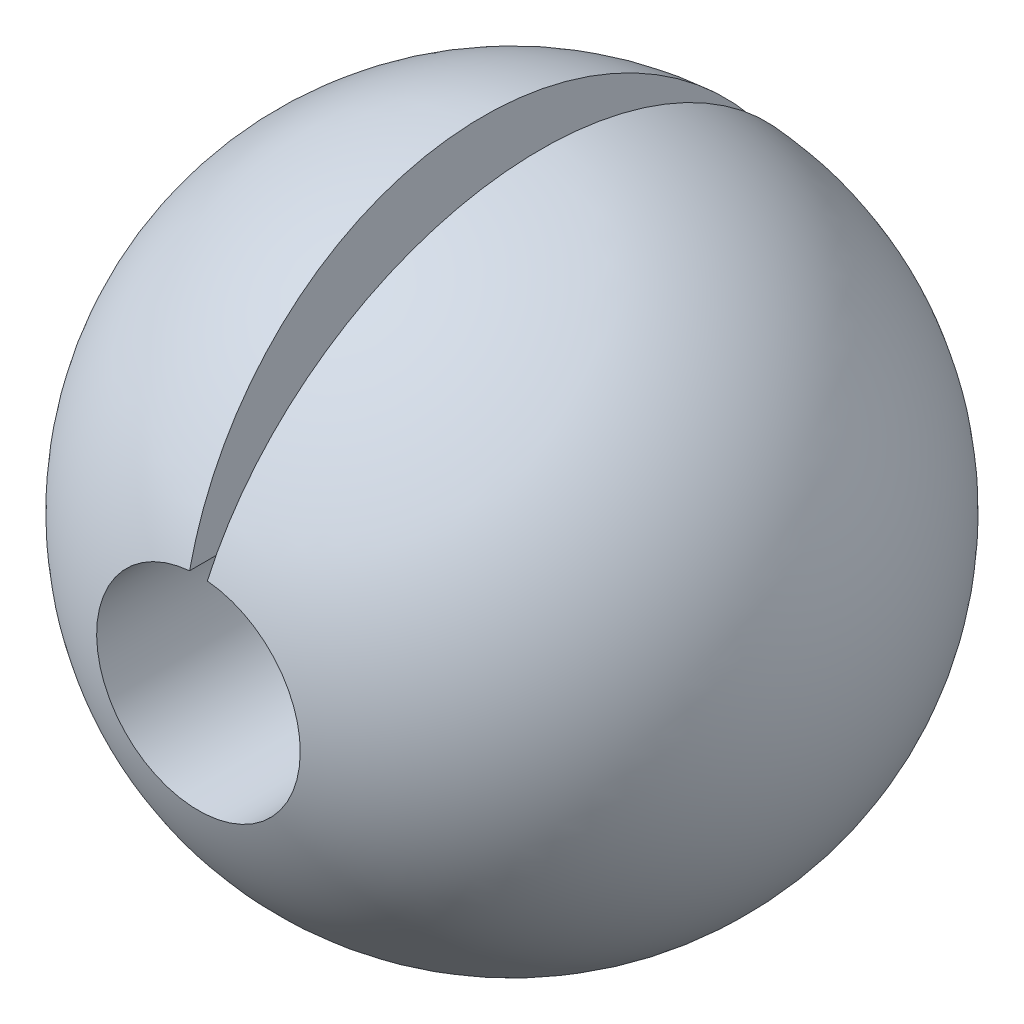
from build123d import *

# Parameters (mm, degrees)
CUT_EXTRUDE_1_DEPTH      = 1115.60486272
CUT_EXTRUDE_1_DEPTH_BACK = 1115.60486272


with BuildPart() as part:
    # Sketch 1 → Revolve 1 (revolve)
    with BuildSketch(Plane(origin=(0, 0, 0), x_dir=(1, 0, 0), z_dir=(0, 1, 0))):
        with BuildLine():
            Line((-202, 622.022507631), (-202, -622.022507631))
            ThreePointArc((-202, -622.022507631), (-654, 0), (-202, 622.022507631))
        make_face()
    revolve(axis=Axis((0, 0, 0), (0, 0, -1)))

    # Sketch 2 → Cut-Extrude 1 (cut, two sides: drawn at the far end of the back side and taken through both)
    with BuildSketch(Plane.XY.offset(-CUT_EXTRUDE_1_DEPTH_BACK)):
        Polygon((0, 0), (-88.834663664, 1015.384851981), (88.834663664, 1015.384851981), align=None)
    extrude(amount=CUT_EXTRUDE_1_DEPTH + CUT_EXTRUDE_1_DEPTH_BACK, mode=Mode.SUBTRACT)


solid = part.part
